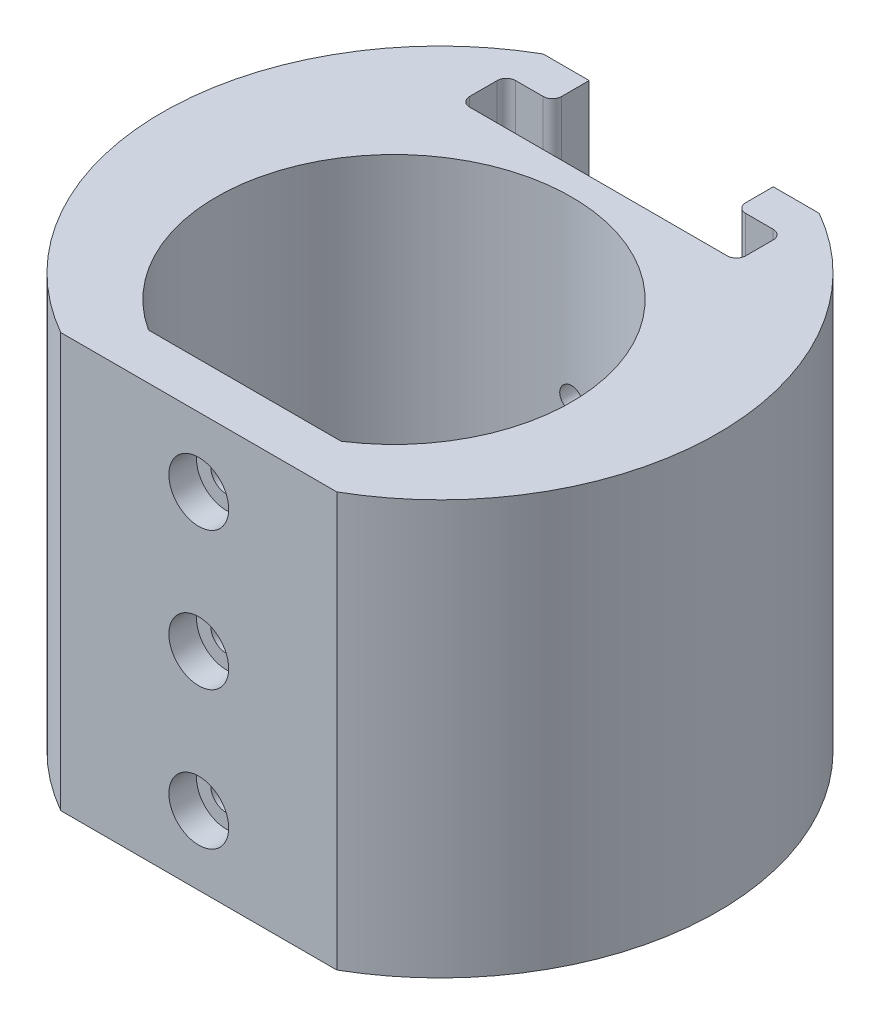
ISO-10303-21;
HEADER;
FILE_DESCRIPTION(('STEP AP214'),'2;1');
FILE_NAME('part.step','',(''),(''),'','','');
FILE_SCHEMA(('AUTOMOTIVE_DESIGN { 1 0 10303 214 1 1 1 1 }'));
ENDSEC;
DATA;
#1=APPLICATION_CONTEXT('core data for automotive mechanical design processes');
#2=APPLICATION_PROTOCOL_DEFINITION('international standard','automotive_design',2000,#1);
#3=PRODUCT_CONTEXT('',#1,'mechanical');
#4=PRODUCT('Part','Part','',(#3));
#5=PRODUCT_RELATED_PRODUCT_CATEGORY('part','',(#4));
#6=PRODUCT_DEFINITION_FORMATION('','',#4);
#7=PRODUCT_DEFINITION_CONTEXT('part definition',#1,'design');
#8=PRODUCT_DEFINITION('design','',#6,#7);
#9=PRODUCT_DEFINITION_SHAPE('','',#8);
#10=(LENGTH_UNIT() NAMED_UNIT(*) SI_UNIT(.MILLI.,.METRE.));
#11=(NAMED_UNIT(*) PLANE_ANGLE_UNIT() SI_UNIT($,.RADIAN.));
#12=(NAMED_UNIT(*) SI_UNIT($,.STERADIAN.) SOLID_ANGLE_UNIT());
#13=UNCERTAINTY_MEASURE_WITH_UNIT(LENGTH_MEASURE(1.E-05),#10,'distance_accuracy_value','');
#14=(GEOMETRIC_REPRESENTATION_CONTEXT(3) GLOBAL_UNCERTAINTY_ASSIGNED_CONTEXT((#13)) GLOBAL_UNIT_ASSIGNED_CONTEXT((#10,
#11,#12)) REPRESENTATION_CONTEXT('',''));
#15=CARTESIAN_POINT('',(0.,0.,0.));
#16=DIRECTION('',(0.,0.,1.));
#17=DIRECTION('',(1.,0.,0.));
#18=AXIS2_PLACEMENT_3D('',#15,#16,#17);
#19=CARTESIAN_POINT('',(0.,22.5,-5.));
#20=DIRECTION('',(0.,1.,0.));
#21=DIRECTION('',(0.,0.,1.));
#22=AXIS2_PLACEMENT_3D('',#19,#20,#21);
#23=PLANE('',#22);
#24=DIRECTION('',(0.,0.,-1.));
#25=VECTOR('',#24,1.);
#26=CARTESIAN_POINT('',(10.,22.5,-27.2142684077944));
#27=LINE('',#26,#25);
#28=CARTESIAN_POINT('',(10.,22.5,-28.2142684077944));
#29=VERTEX_POINT('',#28);
#30=CARTESIAN_POINT('',(10.,22.5,-31.2142684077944));
#31=VERTEX_POINT('',#30);
#32=EDGE_CURVE('E384',#29,#31,#27,.T.);
#33=ORIENTED_EDGE('',*,*,#32,.F.);
#34=CARTESIAN_POINT('',(11.,22.5,-28.2142684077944));
#35=DIRECTION('',(0.,1.,0.));
#36=DIRECTION('',(0.,0.,1.));
#37=AXIS2_PLACEMENT_3D('',#34,#35,#36);
#38=CIRCLE('',#37,1.);
#39=CARTESIAN_POINT('',(11.,22.5,-27.2142684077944));
#40=VERTEX_POINT('',#39);
#41=EDGE_CURVE('E438',#29,#40,#38,.T.);
#42=ORIENTED_EDGE('',*,*,#41,.T.);
#43=DIRECTION('',(-1.,0.,0.));
#44=VECTOR('',#43,1.);
#45=CARTESIAN_POINT('',(15.,22.5,-27.2142684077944));
#46=LINE('',#45,#44);
#47=CARTESIAN_POINT('',(14.,22.5,-27.2142684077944));
#48=VERTEX_POINT('',#47);
#49=EDGE_CURVE('E381',#48,#40,#46,.T.);
#50=ORIENTED_EDGE('',*,*,#49,.F.);
#51=CARTESIAN_POINT('',(14.,22.5,-26.2142684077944));
#52=DIRECTION('',(0.,1.,0.));
#53=DIRECTION('',(0.,0.,1.));
#54=AXIS2_PLACEMENT_3D('',#51,#52,#53);
#55=CIRCLE('',#54,1.);
#56=CARTESIAN_POINT('',(15.,22.5,-26.2142684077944));
#57=VERTEX_POINT('',#56);
#58=EDGE_CURVE('E220',#48,#57,#55,.F.);
#59=ORIENTED_EDGE('',*,*,#58,.T.);
#60=DIRECTION('',(0.,0.,-1.));
#61=VECTOR('',#60,1.);
#62=CARTESIAN_POINT('',(15.,22.5,-22.2142684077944));
#63=LINE('',#62,#61);
#64=CARTESIAN_POINT('',(15.,22.5,-23.2142684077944));
#65=VERTEX_POINT('',#64);
#66=EDGE_CURVE('E378',#65,#57,#63,.T.);
#67=ORIENTED_EDGE('',*,*,#66,.F.);
#68=CARTESIAN_POINT('',(14.,22.5,-23.2142684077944));
#69=DIRECTION('',(0.,1.,0.));
#70=DIRECTION('',(0.,0.,1.));
#71=AXIS2_PLACEMENT_3D('',#68,#69,#70);
#72=CIRCLE('',#71,1.);
#73=CARTESIAN_POINT('',(14.,22.5,-22.2142684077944));
#74=VERTEX_POINT('',#73);
#75=EDGE_CURVE('E218',#65,#74,#72,.F.);
#76=ORIENTED_EDGE('',*,*,#75,.T.);
#77=DIRECTION('',(1.,0.,0.));
#78=VECTOR('',#77,1.);
#79=CARTESIAN_POINT('',(-15.,22.5,-22.2142684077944));
#80=LINE('',#79,#78);
#81=CARTESIAN_POINT('',(-14.,22.5,-22.2142684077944));
#82=VERTEX_POINT('',#81);
#83=EDGE_CURVE('E370',#82,#74,#80,.T.);
#84=ORIENTED_EDGE('',*,*,#83,.F.);
#85=CARTESIAN_POINT('',(-14.,22.5,-23.2142684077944));
#86=DIRECTION('',(0.,1.,0.));
#87=DIRECTION('',(0.,0.,1.));
#88=AXIS2_PLACEMENT_3D('',#85,#86,#87);
#89=CIRCLE('',#88,1.);
#90=CARTESIAN_POINT('',(-15.,22.5,-23.2142684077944));
#91=VERTEX_POINT('',#90);
#92=EDGE_CURVE('E222',#82,#91,#89,.F.);
#93=ORIENTED_EDGE('',*,*,#92,.T.);
#94=DIRECTION('',(0.,0.,1.));
#95=VECTOR('',#94,1.);
#96=CARTESIAN_POINT('',(-15.,22.5,-27.2142684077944));
#97=LINE('',#96,#95);
#98=CARTESIAN_POINT('',(-15.,22.5,-26.2142684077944));
#99=VERTEX_POINT('',#98);
#100=EDGE_CURVE('E367',#99,#91,#97,.T.);
#101=ORIENTED_EDGE('',*,*,#100,.F.);
#102=CARTESIAN_POINT('',(-14.,22.5,-26.2142684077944));
#103=DIRECTION('',(0.,1.,0.));
#104=DIRECTION('',(0.,0.,1.));
#105=AXIS2_PLACEMENT_3D('',#102,#103,#104);
#106=CIRCLE('',#105,1.);
#107=CARTESIAN_POINT('',(-14.,22.5,-27.2142684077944));
#108=VERTEX_POINT('',#107);
#109=EDGE_CURVE('E54',#99,#108,#106,.F.);
#110=ORIENTED_EDGE('',*,*,#109,.T.);
#111=DIRECTION('',(-1.,0.,0.));
#112=VECTOR('',#111,1.);
#113=CARTESIAN_POINT('',(-10.,22.5,-27.2142684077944));
#114=LINE('',#113,#112);
#115=CARTESIAN_POINT('',(-11.,22.5,-27.2142684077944));
#116=VERTEX_POINT('',#115);
#117=EDGE_CURVE('E181',#116,#108,#114,.T.);
#118=ORIENTED_EDGE('',*,*,#117,.F.);
#119=CARTESIAN_POINT('',(-11.,22.5,-28.2142684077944));
#120=DIRECTION('',(0.,1.,0.));
#121=DIRECTION('',(0.,0.,1.));
#122=AXIS2_PLACEMENT_3D('',#119,#120,#121);
#123=CIRCLE('',#122,1.);
#124=CARTESIAN_POINT('',(-10.,22.5,-28.2142684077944));
#125=VERTEX_POINT('',#124);
#126=EDGE_CURVE('E361',#116,#125,#123,.T.);
#127=ORIENTED_EDGE('',*,*,#126,.T.);
#128=DIRECTION('',(0.,0.,1.));
#129=VECTOR('',#128,1.);
#130=CARTESIAN_POINT('',(-10.,22.5,-31.2142684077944));
#131=LINE('',#130,#129);
#132=CARTESIAN_POINT('',(-10.,22.5,-31.2142684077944));
#133=VERTEX_POINT('',#132);
#134=EDGE_CURVE('E368',#133,#125,#131,.T.);
#135=ORIENTED_EDGE('',*,*,#134,.F.);
#136=DIRECTION('',(-1.,0.,0.));
#137=VECTOR('',#136,1.);
#138=CARTESIAN_POINT('',(-15.,22.5,-31.2142684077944));
#139=LINE('',#138,#137);
#140=CARTESIAN_POINT('',(-15.,22.5,-31.2142684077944));
#141=VERTEX_POINT('',#140);
#142=EDGE_CURVE('E411',#133,#141,#139,.T.);
#143=ORIENTED_EDGE('',*,*,#142,.T.);
#144=CARTESIAN_POINT('',(0.,22.5,-5.));
#145=DIRECTION('',(0.,1.,0.));
#146=DIRECTION('',(0.,0.,1.));
#147=AXIS2_PLACEMENT_3D('',#144,#145,#146);
#148=CIRCLE('',#147,30.2024480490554);
#149=CARTESIAN_POINT('',(-15.,22.5,21.2142684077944));
#150=VERTEX_POINT('',#149);
#151=EDGE_CURVE('E401',#141,#150,#148,.T.);
#152=ORIENTED_EDGE('',*,*,#151,.T.);
#153=DIRECTION('',(1.,0.,0.));
#154=VECTOR('',#153,1.);
#155=CARTESIAN_POINT('',(-15.,22.5,21.2142684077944));
#156=LINE('',#155,#154);
#157=CARTESIAN_POINT('',(15.,22.5,21.2142684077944));
#158=VERTEX_POINT('',#157);
#159=EDGE_CURVE('E404',#150,#158,#156,.T.);
#160=ORIENTED_EDGE('',*,*,#159,.T.);
#161=CARTESIAN_POINT('',(0.,22.5,-5.));
#162=DIRECTION('',(0.,1.,0.));
#163=DIRECTION('',(0.,0.,1.));
#164=AXIS2_PLACEMENT_3D('',#161,#162,#163);
#165=CIRCLE('',#164,30.2024480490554);
#166=CARTESIAN_POINT('',(15.,22.5,-31.2142684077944));
#167=VERTEX_POINT('',#166);
#168=EDGE_CURVE('E408',#158,#167,#165,.T.);
#169=ORIENTED_EDGE('',*,*,#168,.T.);
#170=EDGE_CURVE('E412',#167,#31,#139,.T.);
#171=ORIENTED_EDGE('',*,*,#170,.T.);
#172=EDGE_LOOP('',(#33,#42,#50,#59,#67,#76,#84,#93,#101,#110,#118,#127,#135,#143,#152,#160,#169,#171));
#173=FACE_BOUND('',#172,.T.);
#174=DIRECTION('',(1.,0.,0.));
#175=VECTOR('',#174,1.);
#176=CARTESIAN_POINT('',(-10.,22.5,16.2142684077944));
#177=LINE('',#176,#175);
#178=CARTESIAN_POINT('',(-10.4684048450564,22.5,16.2142684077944));
#179=VERTEX_POINT('',#178);
#180=CARTESIAN_POINT('',(10.4684048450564,22.5,16.2142684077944));
#181=VERTEX_POINT('',#180);
#182=EDGE_CURVE('E83',#179,#181,#177,.T.);
#183=ORIENTED_EDGE('',*,*,#182,.F.);
#184=CARTESIAN_POINT('',(0.,22.5,0.));
#185=DIRECTION('',(0.,1.,0.));
#186=DIRECTION('',(0.,0.,1.));
#187=AXIS2_PLACEMENT_3D('',#184,#185,#186);
#188=CIRCLE('',#187,19.3);
#189=EDGE_CURVE('E397',#181,#179,#188,.T.);
#190=ORIENTED_EDGE('',*,*,#189,.F.);
#191=EDGE_LOOP('',(#183,#190));
#192=FACE_BOUND('',#191,.T.);
#193=ADVANCED_FACE('F43',(#173,#192),#23,.T.);
#194=CARTESIAN_POINT('',(0.,-22.5,-5.));
#195=DIRECTION('',(0.,1.,0.));
#196=DIRECTION('',(0.,0.,1.));
#197=AXIS2_PLACEMENT_3D('',#194,#195,#196);
#198=PLANE('',#197);
#199=CARTESIAN_POINT('',(0.,-22.5,-5.));
#200=DIRECTION('',(0.,1.,0.));
#201=DIRECTION('',(0.,0.,1.));
#202=AXIS2_PLACEMENT_3D('',#199,#200,#201);
#203=CIRCLE('',#202,30.2024480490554);
#204=CARTESIAN_POINT('',(-15.,-22.5,-31.2142684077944));
#205=VERTEX_POINT('',#204);
#206=CARTESIAN_POINT('',(-15.,-22.5,21.2142684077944));
#207=VERTEX_POINT('',#206);
#208=EDGE_CURVE('E416',#205,#207,#203,.T.);
#209=ORIENTED_EDGE('',*,*,#208,.F.);
#210=DIRECTION('',(-1.,0.,0.));
#211=VECTOR('',#210,1.);
#212=CARTESIAN_POINT('',(-15.,-22.5,-31.2142684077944));
#213=LINE('',#212,#211);
#214=CARTESIAN_POINT('',(15.,-22.5,-31.2142684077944));
#215=VERTEX_POINT('',#214);
#216=EDGE_CURVE('E405',#215,#205,#213,.T.);
#217=ORIENTED_EDGE('',*,*,#216,.F.);
#218=CARTESIAN_POINT('',(0.,-22.5,-5.));
#219=DIRECTION('',(0.,1.,0.));
#220=DIRECTION('',(0.,0.,1.));
#221=AXIS2_PLACEMENT_3D('',#218,#219,#220);
#222=CIRCLE('',#221,30.2024480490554);
#223=CARTESIAN_POINT('',(15.,-22.5,21.2142684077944));
#224=VERTEX_POINT('',#223);
#225=EDGE_CURVE('E421',#224,#215,#222,.T.);
#226=ORIENTED_EDGE('',*,*,#225,.F.);
#227=DIRECTION('',(1.,0.,0.));
#228=VECTOR('',#227,1.);
#229=CARTESIAN_POINT('',(-15.,-22.5,21.2142684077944));
#230=LINE('',#229,#228);
#231=EDGE_CURVE('E92',#207,#224,#230,.T.);
#232=ORIENTED_EDGE('',*,*,#231,.F.);
#233=EDGE_LOOP('',(#209,#217,#226,#232));
#234=FACE_BOUND('',#233,.T.);
#235=CARTESIAN_POINT('',(0.,-22.5,0.));
#236=DIRECTION('',(0.,1.,0.));
#237=DIRECTION('',(0.,0.,1.));
#238=AXIS2_PLACEMENT_3D('',#235,#236,#237);
#239=CIRCLE('',#238,19.3);
#240=CARTESIAN_POINT('',(10.4684048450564,-22.5,16.2142684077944));
#241=VERTEX_POINT('',#240);
#242=CARTESIAN_POINT('',(-10.4684048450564,-22.5,16.2142684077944));
#243=VERTEX_POINT('',#242);
#244=EDGE_CURVE('E391',#241,#243,#239,.T.);
#245=ORIENTED_EDGE('',*,*,#244,.T.);
#246=DIRECTION('',(1.,0.,0.));
#247=VECTOR('',#246,1.);
#248=CARTESIAN_POINT('',(-10.,-22.5,16.2142684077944));
#249=LINE('',#248,#247);
#250=EDGE_CURVE('E398',#243,#241,#249,.T.);
#251=ORIENTED_EDGE('',*,*,#250,.T.);
#252=EDGE_LOOP('',(#245,#251));
#253=FACE_BOUND('',#252,.T.);
#254=ADVANCED_FACE('F320',(#234,#253),#198,.F.);
#255=CARTESIAN_POINT('',(0.,22.5,-5.));
#256=DIRECTION('',(0.,-1.,0.));
#257=DIRECTION('',(0.,0.,-1.));
#258=AXIS2_PLACEMENT_3D('',#255,#256,#257);
#259=CYLINDRICAL_SURFACE('',#258,30.2024480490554);
#260=ORIENTED_EDGE('',*,*,#208,.T.);
#261=DIRECTION('',(0.,-1.,0.));
#262=VECTOR('',#261,1.);
#263=CARTESIAN_POINT('',(-15.,22.5,21.2142684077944));
#264=LINE('',#263,#262);
#265=EDGE_CURVE('E432',#150,#207,#264,.T.);
#266=ORIENTED_EDGE('',*,*,#265,.F.);
#267=ORIENTED_EDGE('',*,*,#151,.F.);
#268=DIRECTION('',(0.,-1.,0.));
#269=VECTOR('',#268,1.);
#270=CARTESIAN_POINT('',(-15.,22.5,-31.2142684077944));
#271=LINE('',#270,#269);
#272=EDGE_CURVE('E415',#141,#205,#271,.T.);
#273=ORIENTED_EDGE('',*,*,#272,.T.);
#274=EDGE_LOOP('',(#260,#266,#267,#273));
#275=FACE_BOUND('',#274,.T.);
#276=ADVANCED_FACE('F324',(#275),#259,.T.);
#277=CARTESIAN_POINT('',(-15.,22.5,21.2142684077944));
#278=DIRECTION('',(0.,0.,-1.));
#279=DIRECTION('',(-1.,0.,0.));
#280=AXIS2_PLACEMENT_3D('',#277,#278,#279);
#281=PLANE('',#280);
#282=CARTESIAN_POINT('',(0.,15.,21.2142684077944));
#283=DIRECTION('',(0.,0.,1.));
#284=DIRECTION('',(1.,0.,0.));
#285=AXIS2_PLACEMENT_3D('',#282,#283,#284);
#286=CIRCLE('',#285,3.25);
#287=CARTESIAN_POINT('',(3.25,15.,21.2142684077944));
#288=VERTEX_POINT('',#287);
#289=EDGE_CURVE('E512',#288,#288,#286,.T.);
#290=ORIENTED_EDGE('',*,*,#289,.F.);
#291=EDGE_LOOP('',(#290));
#292=FACE_BOUND('',#291,.T.);
#293=CARTESIAN_POINT('',(0.,0.,21.2142684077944));
#294=DIRECTION('',(0.,0.,1.));
#295=DIRECTION('',(1.,0.,0.));
#296=AXIS2_PLACEMENT_3D('',#293,#294,#295);
#297=CIRCLE('',#296,3.25);
#298=CARTESIAN_POINT('',(3.25,0.,21.2142684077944));
#299=VERTEX_POINT('',#298);
#300=EDGE_CURVE('E500',#299,#299,#297,.T.);
#301=ORIENTED_EDGE('',*,*,#300,.F.);
#302=EDGE_LOOP('',(#301));
#303=FACE_BOUND('',#302,.T.);
#304=CARTESIAN_POINT('',(1.56198175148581E-13,-15.,21.2142684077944));
#305=DIRECTION('',(0.,0.,1.));
#306=DIRECTION('',(1.,0.,0.));
#307=AXIS2_PLACEMENT_3D('',#304,#305,#306);
#308=CIRCLE('',#307,3.25);
#309=CARTESIAN_POINT('',(3.25000000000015,-15.,21.2142684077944));
#310=VERTEX_POINT('',#309);
#311=EDGE_CURVE('E488',#310,#310,#308,.T.);
#312=ORIENTED_EDGE('',*,*,#311,.F.);
#313=EDGE_LOOP('',(#312));
#314=FACE_BOUND('',#313,.T.);
#315=ORIENTED_EDGE('',*,*,#231,.T.);
#316=DIRECTION('',(0.,-1.,0.));
#317=VECTOR('',#316,1.);
#318=CARTESIAN_POINT('',(15.,22.5,21.2142684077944));
#319=LINE('',#318,#317);
#320=EDGE_CURVE('E429',#158,#224,#319,.T.);
#321=ORIENTED_EDGE('',*,*,#320,.F.);
#322=ORIENTED_EDGE('',*,*,#159,.F.);
#323=ORIENTED_EDGE('',*,*,#265,.T.);
#324=EDGE_LOOP('',(#315,#321,#322,#323));
#325=FACE_BOUND('',#324,.T.);
#326=ADVANCED_FACE('F332',(#292,#303,#314,#325),#281,.F.);
#327=CARTESIAN_POINT('',(0.,22.5,-5.));
#328=DIRECTION('',(0.,-1.,0.));
#329=DIRECTION('',(0.,0.,-1.));
#330=AXIS2_PLACEMENT_3D('',#327,#328,#329);
#331=CYLINDRICAL_SURFACE('',#330,30.2024480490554);
#332=ORIENTED_EDGE('',*,*,#225,.T.);
#333=DIRECTION('',(0.,-1.,0.));
#334=VECTOR('',#333,1.);
#335=CARTESIAN_POINT('',(15.,22.5,-31.2142684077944));
#336=LINE('',#335,#334);
#337=EDGE_CURVE('E426',#167,#215,#336,.T.);
#338=ORIENTED_EDGE('',*,*,#337,.F.);
#339=ORIENTED_EDGE('',*,*,#168,.F.);
#340=ORIENTED_EDGE('',*,*,#320,.T.);
#341=EDGE_LOOP('',(#332,#338,#339,#340));
#342=FACE_BOUND('',#341,.T.);
#343=ADVANCED_FACE('F328',(#342),#331,.T.);
#344=CARTESIAN_POINT('',(-15.,22.5,-31.2142684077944));
#345=DIRECTION('',(0.,0.,1.));
#346=DIRECTION('',(1.,0.,0.));
#347=AXIS2_PLACEMENT_3D('',#344,#345,#346);
#348=PLANE('',#347);
#349=DIRECTION('',(-1.,0.,0.));
#350=VECTOR('',#349,1.);
#351=CARTESIAN_POINT('',(10.,-13.5,-31.2142684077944));
#352=LINE('',#351,#350);
#353=CARTESIAN_POINT('',(10.,-13.5,-31.2142684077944));
#354=VERTEX_POINT('',#353);
#355=CARTESIAN_POINT('',(-10.,-13.5,-31.2142684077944));
#356=VERTEX_POINT('',#355);
#357=EDGE_CURVE('E387',#354,#356,#352,.T.);
#358=ORIENTED_EDGE('',*,*,#357,.F.);
#359=DIRECTION('',(0.,1.,0.));
#360=VECTOR('',#359,1.);
#361=CARTESIAN_POINT('',(10.,-13.5,-31.2142684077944));
#362=LINE('',#361,#360);
#363=EDGE_CURVE('E388',#354,#31,#362,.T.);
#364=ORIENTED_EDGE('',*,*,#363,.T.);
#365=ORIENTED_EDGE('',*,*,#170,.F.);
#366=ORIENTED_EDGE('',*,*,#337,.T.);
#367=ORIENTED_EDGE('',*,*,#216,.T.);
#368=ORIENTED_EDGE('',*,*,#272,.F.);
#369=ORIENTED_EDGE('',*,*,#142,.F.);
#370=DIRECTION('',(0.,1.,0.));
#371=VECTOR('',#370,1.);
#372=CARTESIAN_POINT('',(-10.,-13.5,-31.2142684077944));
#373=LINE('',#372,#371);
#374=EDGE_CURVE('E392',#356,#133,#373,.T.);
#375=ORIENTED_EDGE('',*,*,#374,.F.);
#376=EDGE_LOOP('',(#358,#364,#365,#366,#367,#368,#369,#375));
#377=FACE_BOUND('',#376,.T.);
#378=ADVANCED_FACE('F325',(#377),#348,.F.);
#379=CARTESIAN_POINT('',(0.,22.5,0.));
#380=DIRECTION('',(0.,-1.,0.));
#381=DIRECTION('',(0.,0.,-1.));
#382=AXIS2_PLACEMENT_3D('',#379,#380,#381);
#383=CYLINDRICAL_SURFACE('',#382,19.3);
#384=CARTESIAN_POINT('',(1.24298409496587,3.36774819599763,-19.2599322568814));
#385=CARTESIAN_POINT('',(1.25039809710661,3.43745864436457,-19.2594541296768));
#386=CARTESIAN_POINT('',(1.25193967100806,3.50784556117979,-19.2593527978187));
#387=CARTESIAN_POINT('',(1.24320212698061,3.64793449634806,-19.2599185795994));
#388=CARTESIAN_POINT('',(1.2329093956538,3.71763563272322,-19.2605865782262));
#389=CARTESIAN_POINT('',(1.20079252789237,3.85428652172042,-19.262615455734));
#390=CARTESIAN_POINT('',(1.17897427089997,3.9212376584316,-19.2639759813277));
#391=CARTESIAN_POINT('',(1.12443836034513,4.05050832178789,-19.2672359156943));
#392=CARTESIAN_POINT('',(1.09172317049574,4.11282889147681,-19.269135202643));
#393=CARTESIAN_POINT('',(1.01627626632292,4.23117199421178,-19.2732614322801));
#394=CARTESIAN_POINT('',(0.973532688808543,4.2871869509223,-19.2754887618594));
#395=CARTESIAN_POINT('',(0.879257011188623,4.39125587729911,-19.2800188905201));
#396=CARTESIAN_POINT('',(0.827724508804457,4.43930948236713,-19.282321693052));
#397=CARTESIAN_POINT('',(0.717243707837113,4.52616074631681,-19.286747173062));
#398=CARTESIAN_POINT('',(0.658284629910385,4.56494470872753,-19.2888695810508));
#399=CARTESIAN_POINT('',(0.5346786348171,4.63206203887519,-19.2926912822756));
#400=CARTESIAN_POINT('',(0.470031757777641,4.66039548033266,-19.2943905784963));
#401=CARTESIAN_POINT('',(0.336936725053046,4.70578326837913,-19.2971732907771));
#402=CARTESIAN_POINT('',(0.268491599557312,4.72284646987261,-19.2982571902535));
#403=CARTESIAN_POINT('',(0.129700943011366,4.74523835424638,-19.2996889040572));
#404=CARTESIAN_POINT('',(0.0593554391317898,4.7505672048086,-19.3000367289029));
#405=CARTESIAN_POINT('',(-0.0811021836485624,4.7493382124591,-19.2999571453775));
#406=CARTESIAN_POINT('',(-0.151214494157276,4.74280205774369,-19.2995311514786));
#407=CARTESIAN_POINT('',(-0.2893438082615,4.71807347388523,-19.2979546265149));
#408=CARTESIAN_POINT('',(-0.357360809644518,4.69988103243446,-19.2968040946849));
#409=CARTESIAN_POINT('',(-0.48937139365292,4.65236142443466,-19.2939078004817));
#410=CARTESIAN_POINT('',(-0.553365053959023,4.62303447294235,-19.2921620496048));
#411=CARTESIAN_POINT('',(-0.675525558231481,4.55408009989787,-19.2882711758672));
#412=CARTESIAN_POINT('',(-0.733692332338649,4.51445255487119,-19.2861260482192));
#413=CARTESIAN_POINT('',(-0.842661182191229,4.42593648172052,-19.2816728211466));
#414=CARTESIAN_POINT('',(-0.893449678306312,4.37703125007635,-19.2793644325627));
#415=CARTESIAN_POINT('',(-0.986101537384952,4.27138836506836,-19.2748478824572));
#416=CARTESIAN_POINT('',(-1.0279648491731,4.21465066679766,-19.2726397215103));
#417=CARTESIAN_POINT('',(-1.10161048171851,4.09489464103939,-19.2685708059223));
#418=CARTESIAN_POINT('',(-1.13338442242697,4.03187114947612,-19.2667103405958));
#419=CARTESIAN_POINT('',(-1.18589596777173,3.90136969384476,-19.2635496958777));
#420=CARTESIAN_POINT('',(-1.20663368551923,3.83389177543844,-19.2622495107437));
#421=CARTESIAN_POINT('',(-1.23645514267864,3.69650146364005,-19.2603583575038));
#422=CARTESIAN_POINT('',(-1.24555583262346,3.62659276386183,-19.2597663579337));
#423=CARTESIAN_POINT('',(-1.25189673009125,3.48623762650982,-19.2593552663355));
#424=CARTESIAN_POINT('',(-1.24913705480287,3.41579119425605,-19.2595361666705));
#425=CARTESIAN_POINT('',(-1.23184994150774,3.27646941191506,-19.2606494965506));
#426=CARTESIAN_POINT('',(-1.21733982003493,3.20759190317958,-19.2615808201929));
#427=CARTESIAN_POINT('',(-1.1769898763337,3.07325212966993,-19.2640883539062));
#428=CARTESIAN_POINT('',(-1.15114999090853,3.00778988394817,-19.2656645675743));
#429=CARTESIAN_POINT('',(-1.08885144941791,2.88207789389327,-19.2692857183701));
#430=CARTESIAN_POINT('',(-1.05238415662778,2.82183244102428,-19.2713310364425));
#431=CARTESIAN_POINT('',(-0.969872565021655,2.7083111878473,-19.2756594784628));
#432=CARTESIAN_POINT('',(-0.923828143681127,2.65503547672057,-19.2779426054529));
#433=CARTESIAN_POINT('',(-0.823368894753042,2.55686426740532,-19.2824944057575));
#434=CARTESIAN_POINT('',(-0.768938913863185,2.51198427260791,-19.2847630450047));
#435=CARTESIAN_POINT('',(-0.653308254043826,2.43199700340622,-19.2890261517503));
#436=CARTESIAN_POINT('',(-0.592107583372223,2.39688971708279,-19.2910206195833));
#437=CARTESIAN_POINT('',(-0.464667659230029,2.33744788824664,-19.2945106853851));
#438=CARTESIAN_POINT('',(-0.398428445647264,2.31311326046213,-19.2960062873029));
#439=CARTESIAN_POINT('',(-0.262792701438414,2.27591461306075,-19.2983299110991));
#440=CARTESIAN_POINT('',(-0.193396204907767,2.26305046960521,-19.2991579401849));
#441=CARTESIAN_POINT('',(-0.0535516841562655,2.24917607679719,-19.3000521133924));
#442=CARTESIAN_POINT('',(0.0168941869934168,2.24814421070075,-19.3001196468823));
#443=CARTESIAN_POINT('',(0.156957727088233,2.25790801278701,-19.2994888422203));
#444=CARTESIAN_POINT('',(0.226575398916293,2.26870363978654,-19.2987905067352));
#445=CARTESIAN_POINT('',(0.362951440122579,2.30179885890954,-19.2967073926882));
#446=CARTESIAN_POINT('',(0.429711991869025,2.32408949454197,-19.2953231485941));
#447=CARTESIAN_POINT('',(0.558542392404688,2.37953221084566,-19.2920239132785));
#448=CARTESIAN_POINT('',(0.620612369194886,2.4126839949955,-19.2901089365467));
#449=CARTESIAN_POINT('',(0.738396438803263,2.48896068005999,-19.2859600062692));
#450=CARTESIAN_POINT('',(0.794101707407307,2.53209918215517,-19.2837256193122));
#451=CARTESIAN_POINT('',(0.897501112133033,2.62711840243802,-19.2791902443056));
#452=CARTESIAN_POINT('',(0.945193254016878,2.67900129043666,-19.2768892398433));
#453=CARTESIAN_POINT('',(1.03128399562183,2.79013695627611,-19.2724757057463));
#454=CARTESIAN_POINT('',(1.06966462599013,2.84940365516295,-19.2703635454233));
#455=CARTESIAN_POINT('',(1.13588892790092,2.97350945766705,-19.2665737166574));
#456=CARTESIAN_POINT('',(1.16374484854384,3.03834197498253,-19.2648955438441));
#457=CARTESIAN_POINT('',(1.20014400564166,3.14761421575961,-19.2626543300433));
#458=CARTESIAN_POINT('',(1.21202894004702,3.19096770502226,-19.2619074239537));
#459=CARTESIAN_POINT('',(1.23107405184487,3.27870431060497,-19.2606995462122));
#460=CARTESIAN_POINT('',(1.2382342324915,3.32308742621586,-19.2602385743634));
#461=CARTESIAN_POINT('',(1.24298409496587,3.36774819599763,-19.2599322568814));
#462=B_SPLINE_CURVE_WITH_KNOTS('',3,(#384,#385,#386,#387,#388,#389,#390,#391,#392,#393,#394,
#395,#396,#397,#398,#399,#400,#401,#402,#403,#404,#405,#406,#407,#408,#409,#410,#411,#412,#413,
#414,#415,#416,#417,#418,#419,#420,#421,#422,#423,#424,#425,#426,#427,#428,#429,#430,#431,#432,
#433,#434,#435,#436,#437,#438,#439,#440,#441,#442,#443,#444,#445,#446,#447,#448,#449,#450,#451,
#452,#453,#454,#455,#456,#457,#458,#459,#460,#461),.UNSPECIFIED.,.T.,.F.,(4,2,2,2,2,2,2,2,2,2,2,
2,2,2,2,2,2,2,2,2,2,2,2,2,2,2,2,2,2,2,2,2,2,2,2,2,2,2,4),(0.,0.210151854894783,
0.420545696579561,0.630832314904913,0.84107142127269,1.05156049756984,1.26205921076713,
1.47286705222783,1.68367340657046,1.89431393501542,2.10495145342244,2.31520433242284,
2.52545743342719,2.73570647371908,2.94595803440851,3.15659178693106,3.3672267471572,
3.57803620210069,3.78884349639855,3.99934337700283,4.20984117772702,4.42002933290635,
4.63021866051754,4.84057928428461,5.05094259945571,5.26169061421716,5.47243837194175,
5.68318446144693,5.89392827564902,6.10428701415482,6.31464502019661,6.52483937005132,
6.73502798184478,6.945504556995,7.15603343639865,7.36696541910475,7.57765114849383,
7.71228735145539,7.84692346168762),.UNSPECIFIED.);
#463=CARTESIAN_POINT('',(1.24298409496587,3.36774819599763,-19.2599322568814));
#464=VERTEX_POINT('',#463);
#465=EDGE_CURVE('E225',#464,#464,#462,.T.);
#466=ORIENTED_EDGE('',*,*,#465,.F.);
#467=EDGE_LOOP('',(#466));
#468=FACE_BOUND('',#467,.T.);
#469=CARTESIAN_POINT('',(1.24298409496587,-6.63225180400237,-19.2599322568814));
#470=CARTESIAN_POINT('',(1.25039809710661,-6.56254135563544,-19.2594541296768));
#471=CARTESIAN_POINT('',(1.25193967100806,-6.49215443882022,-19.2593527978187));
#472=CARTESIAN_POINT('',(1.24320212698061,-6.35206550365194,-19.2599185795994));
#473=CARTESIAN_POINT('',(1.2329093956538,-6.28236436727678,-19.2605865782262));
#474=CARTESIAN_POINT('',(1.20079252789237,-6.14571347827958,-19.262615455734));
#475=CARTESIAN_POINT('',(1.17897427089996,-6.0787623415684,-19.2639759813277));
#476=CARTESIAN_POINT('',(1.12443836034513,-5.9494916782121,-19.2672359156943));
#477=CARTESIAN_POINT('',(1.09172317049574,-5.88717110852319,-19.269135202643));
#478=CARTESIAN_POINT('',(1.01627626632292,-5.76882800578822,-19.2732614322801));
#479=CARTESIAN_POINT('',(0.973532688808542,-5.7128130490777,-19.2754887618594));
#480=CARTESIAN_POINT('',(0.879257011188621,-5.60874412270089,-19.2800188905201));
#481=CARTESIAN_POINT('',(0.827724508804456,-5.56069051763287,-19.282321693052));
#482=CARTESIAN_POINT('',(0.717243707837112,-5.47383925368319,-19.286747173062));
#483=CARTESIAN_POINT('',(0.658284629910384,-5.43505529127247,-19.2888695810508));
#484=CARTESIAN_POINT('',(0.534678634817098,-5.36793796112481,-19.2926912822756));
#485=CARTESIAN_POINT('',(0.47003175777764,-5.33960451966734,-19.2943905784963));
#486=CARTESIAN_POINT('',(0.336936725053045,-5.29421673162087,-19.2971732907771));
#487=CARTESIAN_POINT('',(0.268491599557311,-5.27715353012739,-19.2982571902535));
#488=CARTESIAN_POINT('',(0.129700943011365,-5.25476164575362,-19.2996889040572));
#489=CARTESIAN_POINT('',(0.0593554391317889,-5.2494327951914,-19.3000367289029));
#490=CARTESIAN_POINT('',(-0.0811021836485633,-5.2506617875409,-19.2999571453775));
#491=CARTESIAN_POINT('',(-0.151214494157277,-5.25719794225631,-19.2995311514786));
#492=CARTESIAN_POINT('',(-0.289343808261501,-5.28192652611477,-19.2979546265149));
#493=CARTESIAN_POINT('',(-0.357360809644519,-5.30011896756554,-19.2968040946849));
#494=CARTESIAN_POINT('',(-0.48937139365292,-5.34763857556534,-19.2939078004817));
#495=CARTESIAN_POINT('',(-0.553365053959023,-5.37696552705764,-19.2921620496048));
#496=CARTESIAN_POINT('',(-0.675525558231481,-5.44591990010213,-19.2882711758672));
#497=CARTESIAN_POINT('',(-0.733692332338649,-5.48554744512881,-19.2861260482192));
#498=CARTESIAN_POINT('',(-0.84266118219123,-5.57406351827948,-19.2816728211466));
#499=CARTESIAN_POINT('',(-0.893449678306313,-5.62296874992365,-19.2793644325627));
#500=CARTESIAN_POINT('',(-0.986101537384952,-5.72861163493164,-19.2748478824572));
#501=CARTESIAN_POINT('',(-1.02796484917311,-5.78534933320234,-19.2726397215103));
#502=CARTESIAN_POINT('',(-1.10161048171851,-5.90510535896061,-19.2685708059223));
#503=CARTESIAN_POINT('',(-1.13338442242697,-5.96812885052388,-19.2667103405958));
#504=CARTESIAN_POINT('',(-1.18589596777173,-6.09863030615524,-19.2635496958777));
#505=CARTESIAN_POINT('',(-1.20663368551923,-6.16610822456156,-19.2622495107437));
#506=CARTESIAN_POINT('',(-1.23645514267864,-6.30349853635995,-19.2603583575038));
#507=CARTESIAN_POINT('',(-1.24555583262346,-6.37340723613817,-19.2597663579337));
#508=CARTESIAN_POINT('',(-1.25189673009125,-6.51376237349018,-19.2593552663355));
#509=CARTESIAN_POINT('',(-1.24913705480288,-6.58420880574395,-19.2595361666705));
#510=CARTESIAN_POINT('',(-1.23184994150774,-6.72353058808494,-19.2606494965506));
#511=CARTESIAN_POINT('',(-1.21733982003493,-6.79240809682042,-19.2615808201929));
#512=CARTESIAN_POINT('',(-1.1769898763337,-6.92674787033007,-19.2640883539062));
#513=CARTESIAN_POINT('',(-1.15114999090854,-6.99221011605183,-19.2656645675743));
#514=CARTESIAN_POINT('',(-1.08885144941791,-7.11792210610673,-19.2692857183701));
#515=CARTESIAN_POINT('',(-1.05238415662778,-7.17816755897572,-19.2713310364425));
#516=CARTESIAN_POINT('',(-0.969872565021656,-7.2916888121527,-19.2756594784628));
#517=CARTESIAN_POINT('',(-0.923828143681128,-7.34496452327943,-19.2779426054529));
#518=CARTESIAN_POINT('',(-0.823368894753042,-7.44313573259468,-19.2824944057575));
#519=CARTESIAN_POINT('',(-0.768938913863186,-7.48801572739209,-19.2847630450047));
#520=CARTESIAN_POINT('',(-0.653308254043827,-7.56800299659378,-19.2890261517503));
#521=CARTESIAN_POINT('',(-0.592107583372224,-7.60311028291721,-19.2910206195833));
#522=CARTESIAN_POINT('',(-0.464667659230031,-7.66255211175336,-19.2945106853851));
#523=CARTESIAN_POINT('',(-0.398428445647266,-7.68688673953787,-19.2960062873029));
#524=CARTESIAN_POINT('',(-0.262792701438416,-7.72408538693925,-19.2983299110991));
#525=CARTESIAN_POINT('',(-0.193396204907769,-7.73694953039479,-19.2991579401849));
#526=CARTESIAN_POINT('',(-0.0535516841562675,-7.75082392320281,-19.3000521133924));
#527=CARTESIAN_POINT('',(0.0168941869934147,-7.75185578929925,-19.3001196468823));
#528=CARTESIAN_POINT('',(0.156957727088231,-7.74209198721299,-19.2994888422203));
#529=CARTESIAN_POINT('',(0.226575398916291,-7.73129636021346,-19.2987905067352));
#530=CARTESIAN_POINT('',(0.362951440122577,-7.69820114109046,-19.2967073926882));
#531=CARTESIAN_POINT('',(0.429711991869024,-7.67591050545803,-19.2953231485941));
#532=CARTESIAN_POINT('',(0.558542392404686,-7.62046778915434,-19.2920239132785));
#533=CARTESIAN_POINT('',(0.620612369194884,-7.5873160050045,-19.2901089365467));
#534=CARTESIAN_POINT('',(0.738396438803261,-7.51103931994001,-19.2859600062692));
#535=CARTESIAN_POINT('',(0.794101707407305,-7.46790081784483,-19.2837256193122));
#536=CARTESIAN_POINT('',(0.897501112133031,-7.37288159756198,-19.2791902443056));
#537=CARTESIAN_POINT('',(0.945193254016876,-7.32099870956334,-19.2768892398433));
#538=CARTESIAN_POINT('',(1.03128399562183,-7.20986304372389,-19.2724757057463));
#539=CARTESIAN_POINT('',(1.06966462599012,-7.15059634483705,-19.2703635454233));
#540=CARTESIAN_POINT('',(1.13588892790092,-7.02649054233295,-19.2665737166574));
#541=CARTESIAN_POINT('',(1.16374484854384,-6.96165802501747,-19.2648955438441));
#542=CARTESIAN_POINT('',(1.20014400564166,-6.85238578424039,-19.2626543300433));
#543=CARTESIAN_POINT('',(1.21202894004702,-6.80903229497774,-19.2619074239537));
#544=CARTESIAN_POINT('',(1.23107405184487,-6.72129568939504,-19.2606995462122));
#545=CARTESIAN_POINT('',(1.2382342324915,-6.67691257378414,-19.2602385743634));
#546=CARTESIAN_POINT('',(1.24298409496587,-6.63225180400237,-19.2599322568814));
#547=B_SPLINE_CURVE_WITH_KNOTS('',3,(#469,#470,#471,#472,#473,#474,#475,#476,#477,#478,#479,
#480,#481,#482,#483,#484,#485,#486,#487,#488,#489,#490,#491,#492,#493,#494,#495,#496,#497,#498,
#499,#500,#501,#502,#503,#504,#505,#506,#507,#508,#509,#510,#511,#512,#513,#514,#515,#516,#517,
#518,#519,#520,#521,#522,#523,#524,#525,#526,#527,#528,#529,#530,#531,#532,#533,#534,#535,#536,
#537,#538,#539,#540,#541,#542,#543,#544,#545,#546),.UNSPECIFIED.,.T.,.F.,(4,2,2,2,2,2,2,2,2,2,2,
2,2,2,2,2,2,2,2,2,2,2,2,2,2,2,2,2,2,2,2,2,2,2,2,2,2,2,4),(0.,0.210151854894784,
0.420545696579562,0.630832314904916,0.84107142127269,1.05156049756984,1.26205921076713,
1.47286705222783,1.68367340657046,1.89431393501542,2.10495145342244,2.31520433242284,
2.52545743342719,2.73570647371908,2.94595803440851,3.15659178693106,3.3672267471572,
3.57803620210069,3.78884349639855,3.99934337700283,4.20984117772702,4.42002933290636,
4.63021866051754,4.84057928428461,5.05094259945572,5.26169061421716,5.47243837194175,
5.68318446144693,5.89392827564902,6.10428701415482,6.31464502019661,6.52483937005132,
6.73502798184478,6.945504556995,7.15603343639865,7.36696541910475,7.57765114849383,
7.71228735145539,7.84692346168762),.UNSPECIFIED.);
#548=CARTESIAN_POINT('',(1.24298409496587,-6.63225180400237,-19.2599322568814));
#549=VERTEX_POINT('',#548);
#550=EDGE_CURVE('E234',#549,#549,#547,.T.);
#551=ORIENTED_EDGE('',*,*,#550,.F.);
#552=EDGE_LOOP('',(#551));
#553=FACE_BOUND('',#552,.T.);
#554=ORIENTED_EDGE('',*,*,#244,.F.);
#555=DIRECTION('',(0.,-1.,0.));
#556=VECTOR('',#555,1.);
#557=CARTESIAN_POINT('',(10.4684048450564,22.5,16.2142684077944));
#558=LINE('',#557,#556);
#559=EDGE_CURVE('E48',#181,#241,#558,.T.);
#560=ORIENTED_EDGE('',*,*,#559,.F.);
#561=ORIENTED_EDGE('',*,*,#189,.T.);
#562=DIRECTION('',(0.,-1.,0.));
#563=VECTOR('',#562,1.);
#564=CARTESIAN_POINT('',(-10.4684048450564,22.5,16.2142684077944));
#565=LINE('',#564,#563);
#566=EDGE_CURVE('E419',#179,#243,#565,.T.);
#567=ORIENTED_EDGE('',*,*,#566,.T.);
#568=EDGE_LOOP('',(#554,#560,#561,#567));
#569=FACE_BOUND('',#568,.T.);
#570=ADVANCED_FACE('F45',(#468,#553,#569),#383,.F.);
#571=CARTESIAN_POINT('',(-10.,22.5,16.2142684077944));
#572=DIRECTION('',(0.,0.,-1.));
#573=DIRECTION('',(-1.,0.,0.));
#574=AXIS2_PLACEMENT_3D('',#571,#572,#573);
#575=PLANE('',#574);
#576=CARTESIAN_POINT('',(0.,15.,16.2142684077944));
#577=DIRECTION('',(0.,0.,-1.));
#578=DIRECTION('',(-1.,0.,0.));
#579=AXIS2_PLACEMENT_3D('',#576,#577,#578);
#580=CIRCLE('',#579,1.7);
#581=CARTESIAN_POINT('',(-1.7,15.,16.2142684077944));
#582=VERTEX_POINT('',#581);
#583=EDGE_CURVE('E508',#582,#582,#580,.F.);
#584=ORIENTED_EDGE('',*,*,#583,.T.);
#585=EDGE_LOOP('',(#584));
#586=FACE_BOUND('',#585,.T.);
#587=CARTESIAN_POINT('',(0.,0.,16.2142684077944));
#588=DIRECTION('',(0.,0.,-1.));
#589=DIRECTION('',(-1.,0.,0.));
#590=AXIS2_PLACEMENT_3D('',#587,#588,#589);
#591=CIRCLE('',#590,1.7);
#592=CARTESIAN_POINT('',(-1.7,0.,16.2142684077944));
#593=VERTEX_POINT('',#592);
#594=EDGE_CURVE('E496',#593,#593,#591,.F.);
#595=ORIENTED_EDGE('',*,*,#594,.T.);
#596=EDGE_LOOP('',(#595));
#597=FACE_BOUND('',#596,.T.);
#598=CARTESIAN_POINT('',(1.56198175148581E-13,-15.,16.2142684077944));
#599=DIRECTION('',(0.,0.,-1.));
#600=DIRECTION('',(-1.,0.,0.));
#601=AXIS2_PLACEMENT_3D('',#598,#599,#600);
#602=CIRCLE('',#601,1.7);
#603=CARTESIAN_POINT('',(-1.69999999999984,-15.,16.2142684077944));
#604=VERTEX_POINT('',#603);
#605=EDGE_CURVE('E484',#604,#604,#602,.F.);
#606=ORIENTED_EDGE('',*,*,#605,.T.);
#607=EDGE_LOOP('',(#606));
#608=FACE_BOUND('',#607,.T.);
#609=ORIENTED_EDGE('',*,*,#250,.F.);
#610=ORIENTED_EDGE('',*,*,#566,.F.);
#611=ORIENTED_EDGE('',*,*,#182,.T.);
#612=ORIENTED_EDGE('',*,*,#559,.T.);
#613=EDGE_LOOP('',(#609,#610,#611,#612));
#614=FACE_BOUND('',#613,.T.);
#615=ADVANCED_FACE('F294',(#586,#597,#608,#614),#575,.T.);
#616=CARTESIAN_POINT('',(10.,-13.5,-27.2142684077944));
#617=DIRECTION('',(1.,0.,0.));
#618=DIRECTION('',(0.,0.,-1.));
#619=AXIS2_PLACEMENT_3D('',#616,#617,#618);
#620=PLANE('',#619);
#621=DIRECTION('',(0.,0.,-1.));
#622=VECTOR('',#621,1.);
#623=CARTESIAN_POINT('',(10.,-13.5,-27.2142684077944));
#624=LINE('',#623,#622);
#625=CARTESIAN_POINT('',(10.,-13.5,-28.2142684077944));
#626=VERTEX_POINT('',#625);
#627=EDGE_CURVE('E395',#626,#354,#624,.T.);
#628=ORIENTED_EDGE('',*,*,#627,.F.);
#629=DIRECTION('',(0.,1.,0.));
#630=VECTOR('',#629,1.);
#631=CARTESIAN_POINT('',(10.,-13.5,-28.2142684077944));
#632=LINE('',#631,#630);
#633=EDGE_CURVE('E434',#626,#29,#632,.T.);
#634=ORIENTED_EDGE('',*,*,#633,.T.);
#635=ORIENTED_EDGE('',*,*,#32,.T.);
#636=ORIENTED_EDGE('',*,*,#363,.F.);
#637=EDGE_LOOP('',(#628,#634,#635,#636));
#638=FACE_BOUND('',#637,.T.);
#639=ADVANCED_FACE('F290',(#638),#620,.F.);
#640=CARTESIAN_POINT('',(15.,-13.5,-27.2142684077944));
#641=DIRECTION('',(0.,0.,-1.));
#642=DIRECTION('',(-1.,0.,0.));
#643=AXIS2_PLACEMENT_3D('',#640,#641,#642);
#644=PLANE('',#643);
#645=ORIENTED_EDGE('',*,*,#49,.T.);
#646=DIRECTION('',(0.,1.,0.));
#647=VECTOR('',#646,1.);
#648=CARTESIAN_POINT('',(11.,-13.5,-27.2142684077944));
#649=LINE('',#648,#647);
#650=CARTESIAN_POINT('',(11.,-13.5,-27.2142684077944));
#651=VERTEX_POINT('',#650);
#652=EDGE_CURVE('E443',#40,#651,#649,.F.);
#653=ORIENTED_EDGE('',*,*,#652,.T.);
#654=DIRECTION('',(-1.,0.,0.));
#655=VECTOR('',#654,1.);
#656=CARTESIAN_POINT('',(15.,-13.5,-27.2142684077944));
#657=LINE('',#656,#655);
#658=CARTESIAN_POINT('',(14.,-13.5,-27.2142684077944));
#659=VERTEX_POINT('',#658);
#660=EDGE_CURVE('E465',#659,#651,#657,.T.);
#661=ORIENTED_EDGE('',*,*,#660,.F.);
#662=DIRECTION('',(0.,1.,0.));
#663=VECTOR('',#662,1.);
#664=CARTESIAN_POINT('',(14.,22.5,-27.2142684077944));
#665=LINE('',#664,#663);
#666=EDGE_CURVE('E440',#659,#48,#665,.T.);
#667=ORIENTED_EDGE('',*,*,#666,.T.);
#668=EDGE_LOOP('',(#645,#653,#661,#667));
#669=FACE_BOUND('',#668,.T.);
#670=ADVANCED_FACE('F293',(#669),#644,.F.);
#671=CARTESIAN_POINT('',(15.,-13.5,-22.2142684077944));
#672=DIRECTION('',(1.,0.,0.));
#673=DIRECTION('',(0.,0.,-1.));
#674=AXIS2_PLACEMENT_3D('',#671,#672,#673);
#675=PLANE('',#674);
#676=DIRECTION('',(0.,0.,-1.));
#677=VECTOR('',#676,1.);
#678=CARTESIAN_POINT('',(15.,-13.5,-22.2142684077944));
#679=LINE('',#678,#677);
#680=CARTESIAN_POINT('',(15.,-13.5,-23.2142684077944));
#681=VERTEX_POINT('',#680);
#682=CARTESIAN_POINT('',(15.,-13.5,-26.2142684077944));
#683=VERTEX_POINT('',#682);
#684=EDGE_CURVE('E463',#681,#683,#679,.T.);
#685=ORIENTED_EDGE('',*,*,#684,.F.);
#686=DIRECTION('',(0.,1.,0.));
#687=VECTOR('',#686,1.);
#688=CARTESIAN_POINT('',(15.,22.5,-23.2142684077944));
#689=LINE('',#688,#687);
#690=EDGE_CURVE('E447',#681,#65,#689,.T.);
#691=ORIENTED_EDGE('',*,*,#690,.T.);
#692=ORIENTED_EDGE('',*,*,#66,.T.);
#693=DIRECTION('',(0.,1.,0.));
#694=VECTOR('',#693,1.);
#695=CARTESIAN_POINT('',(15.,-13.5,-26.2142684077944));
#696=LINE('',#695,#694);
#697=EDGE_CURVE('E445',#57,#683,#696,.F.);
#698=ORIENTED_EDGE('',*,*,#697,.T.);
#699=EDGE_LOOP('',(#685,#691,#692,#698));
#700=FACE_BOUND('',#699,.T.);
#701=ADVANCED_FACE('F298',(#700),#675,.F.);
#702=CARTESIAN_POINT('',(-15.,-13.5,-22.2142684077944));
#703=DIRECTION('',(0.,0.,1.));
#704=DIRECTION('',(1.,0.,0.));
#705=AXIS2_PLACEMENT_3D('',#702,#703,#704);
#706=PLANE('',#705);
#707=CARTESIAN_POINT('',(0.,3.5,-22.2142684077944));
#708=DIRECTION('',(0.,0.,-1.));
#709=DIRECTION('',(-1.,0.,0.));
#710=AXIS2_PLACEMENT_3D('',#707,#708,#709);
#711=CIRCLE('',#710,1.24999999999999);
#712=CARTESIAN_POINT('',(-1.24999999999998,3.5,-22.2142684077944));
#713=VERTEX_POINT('',#712);
#714=EDGE_CURVE('E233',#713,#713,#711,.T.);
#715=ORIENTED_EDGE('',*,*,#714,.F.);
#716=EDGE_LOOP('',(#715));
#717=FACE_BOUND('',#716,.T.);
#718=CARTESIAN_POINT('',(0.,-6.5,-22.2142684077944));
#719=DIRECTION('',(0.,0.,-1.));
#720=DIRECTION('',(-1.,0.,0.));
#721=AXIS2_PLACEMENT_3D('',#718,#719,#720);
#722=CIRCLE('',#721,1.24999999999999);
#723=CARTESIAN_POINT('',(-1.24999999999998,-6.5,-22.2142684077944));
#724=VERTEX_POINT('',#723);
#725=EDGE_CURVE('E232',#724,#724,#722,.T.);
#726=ORIENTED_EDGE('',*,*,#725,.F.);
#727=EDGE_LOOP('',(#726));
#728=FACE_BOUND('',#727,.T.);
#729=ORIENTED_EDGE('',*,*,#83,.T.);
#730=DIRECTION('',(0.,1.,0.));
#731=VECTOR('',#730,1.);
#732=CARTESIAN_POINT('',(14.,-13.5,-22.2142684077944));
#733=LINE('',#732,#731);
#734=CARTESIAN_POINT('',(14.,-13.5,-22.2142684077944));
#735=VERTEX_POINT('',#734);
#736=EDGE_CURVE('E201',#74,#735,#733,.F.);
#737=ORIENTED_EDGE('',*,*,#736,.T.);
#738=DIRECTION('',(1.,0.,0.));
#739=VECTOR('',#738,1.);
#740=CARTESIAN_POINT('',(-15.,-13.5,-22.2142684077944));
#741=LINE('',#740,#739);
#742=CARTESIAN_POINT('',(-14.,-13.5,-22.2142684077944));
#743=VERTEX_POINT('',#742);
#744=EDGE_CURVE('E455',#743,#735,#741,.T.);
#745=ORIENTED_EDGE('',*,*,#744,.F.);
#746=DIRECTION('',(0.,1.,0.));
#747=VECTOR('',#746,1.);
#748=CARTESIAN_POINT('',(-14.,22.5,-22.2142684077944));
#749=LINE('',#748,#747);
#750=EDGE_CURVE('E205',#743,#82,#749,.T.);
#751=ORIENTED_EDGE('',*,*,#750,.T.);
#752=EDGE_LOOP('',(#729,#737,#745,#751));
#753=FACE_BOUND('',#752,.T.);
#754=ADVANCED_FACE('F302',(#717,#728,#753),#706,.F.);
#755=CARTESIAN_POINT('',(-15.,-13.5,-27.2142684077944));
#756=DIRECTION('',(-1.,0.,0.));
#757=DIRECTION('',(0.,0.,1.));
#758=AXIS2_PLACEMENT_3D('',#755,#756,#757);
#759=PLANE('',#758);
#760=ORIENTED_EDGE('',*,*,#100,.T.);
#761=DIRECTION('',(0.,1.,0.));
#762=VECTOR('',#761,1.);
#763=CARTESIAN_POINT('',(-15.,-13.5,-23.2142684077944));
#764=LINE('',#763,#762);
#765=CARTESIAN_POINT('',(-15.,-13.5,-23.2142684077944));
#766=VERTEX_POINT('',#765);
#767=EDGE_CURVE('E63',#91,#766,#764,.F.);
#768=ORIENTED_EDGE('',*,*,#767,.T.);
#769=DIRECTION('',(0.,0.,1.));
#770=VECTOR('',#769,1.);
#771=CARTESIAN_POINT('',(-15.,-13.5,-27.2142684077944));
#772=LINE('',#771,#770);
#773=CARTESIAN_POINT('',(-15.,-13.5,-26.2142684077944));
#774=VERTEX_POINT('',#773);
#775=EDGE_CURVE('E193',#774,#766,#772,.T.);
#776=ORIENTED_EDGE('',*,*,#775,.F.);
#777=DIRECTION('',(0.,1.,0.));
#778=VECTOR('',#777,1.);
#779=CARTESIAN_POINT('',(-15.,22.5,-26.2142684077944));
#780=LINE('',#779,#778);
#781=EDGE_CURVE('E199',#774,#99,#780,.T.);
#782=ORIENTED_EDGE('',*,*,#781,.T.);
#783=EDGE_LOOP('',(#760,#768,#776,#782));
#784=FACE_BOUND('',#783,.T.);
#785=ADVANCED_FACE('F306',(#784),#759,.F.);
#786=CARTESIAN_POINT('',(-10.,-13.5,-27.2142684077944));
#787=DIRECTION('',(0.,0.,-1.));
#788=DIRECTION('',(-1.,0.,0.));
#789=AXIS2_PLACEMENT_3D('',#786,#787,#788);
#790=PLANE('',#789);
#791=ORIENTED_EDGE('',*,*,#117,.T.);
#792=DIRECTION('',(0.,1.,0.));
#793=VECTOR('',#792,1.);
#794=CARTESIAN_POINT('',(-14.,-13.5,-27.2142684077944));
#795=LINE('',#794,#793);
#796=CARTESIAN_POINT('',(-14.,-13.5,-27.2142684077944));
#797=VERTEX_POINT('',#796);
#798=EDGE_CURVE('E174',#108,#797,#795,.F.);
#799=ORIENTED_EDGE('',*,*,#798,.T.);
#800=DIRECTION('',(-1.,0.,0.));
#801=VECTOR('',#800,1.);
#802=CARTESIAN_POINT('',(-10.,-13.5,-27.2142684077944));
#803=LINE('',#802,#801);
#804=CARTESIAN_POINT('',(-11.,-13.5,-27.2142684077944));
#805=VERTEX_POINT('',#804);
#806=EDGE_CURVE('E178',#805,#797,#803,.T.);
#807=ORIENTED_EDGE('',*,*,#806,.F.);
#808=DIRECTION('',(0.,1.,0.));
#809=VECTOR('',#808,1.);
#810=CARTESIAN_POINT('',(-11.,-13.5,-27.2142684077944));
#811=LINE('',#810,#809);
#812=EDGE_CURVE('E185',#805,#116,#811,.T.);
#813=ORIENTED_EDGE('',*,*,#812,.T.);
#814=EDGE_LOOP('',(#791,#799,#807,#813));
#815=FACE_BOUND('',#814,.T.);
#816=ADVANCED_FACE('F176',(#815),#790,.F.);
#817=CARTESIAN_POINT('',(-10.,-13.5,-31.2142684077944));
#818=DIRECTION('',(-1.,0.,0.));
#819=DIRECTION('',(0.,0.,1.));
#820=AXIS2_PLACEMENT_3D('',#817,#818,#819);
#821=PLANE('',#820);
#822=ORIENTED_EDGE('',*,*,#134,.T.);
#823=DIRECTION('',(0.,1.,0.));
#824=VECTOR('',#823,1.);
#825=CARTESIAN_POINT('',(-10.,-13.5,-28.2142684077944));
#826=LINE('',#825,#824);
#827=CARTESIAN_POINT('',(-10.,-13.5,-28.2142684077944));
#828=VERTEX_POINT('',#827);
#829=EDGE_CURVE('E184',#125,#828,#826,.F.);
#830=ORIENTED_EDGE('',*,*,#829,.T.);
#831=DIRECTION('',(0.,0.,1.));
#832=VECTOR('',#831,1.);
#833=CARTESIAN_POINT('',(-10.,-13.5,-31.2142684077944));
#834=LINE('',#833,#832);
#835=EDGE_CURVE('E194',#356,#828,#834,.T.);
#836=ORIENTED_EDGE('',*,*,#835,.F.);
#837=ORIENTED_EDGE('',*,*,#374,.T.);
#838=EDGE_LOOP('',(#822,#830,#836,#837));
#839=FACE_BOUND('',#838,.T.);
#840=ADVANCED_FACE('F289',(#839),#821,.F.);
#841=CARTESIAN_POINT('',(0.,-13.5,0.));
#842=DIRECTION('',(0.,1.,0.));
#843=DIRECTION('',(0.,0.,1.));
#844=AXIS2_PLACEMENT_3D('',#841,#842,#843);
#845=PLANE('',#844);
#846=ORIENTED_EDGE('',*,*,#744,.T.);
#847=CARTESIAN_POINT('',(14.,-13.5,-23.2142684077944));
#848=DIRECTION('',(0.,1.,0.));
#849=DIRECTION('',(0.,0.,1.));
#850=AXIS2_PLACEMENT_3D('',#847,#848,#849);
#851=CIRCLE('',#850,1.);
#852=EDGE_CURVE('E210',#735,#681,#851,.T.);
#853=ORIENTED_EDGE('',*,*,#852,.T.);
#854=ORIENTED_EDGE('',*,*,#684,.T.);
#855=CARTESIAN_POINT('',(14.,-13.5,-26.2142684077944));
#856=DIRECTION('',(0.,1.,0.));
#857=DIRECTION('',(0.,0.,1.));
#858=AXIS2_PLACEMENT_3D('',#855,#856,#857);
#859=CIRCLE('',#858,1.);
#860=EDGE_CURVE('E203',#683,#659,#859,.T.);
#861=ORIENTED_EDGE('',*,*,#860,.T.);
#862=ORIENTED_EDGE('',*,*,#660,.T.);
#863=CARTESIAN_POINT('',(11.,-13.5,-28.2142684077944));
#864=DIRECTION('',(0.,1.,0.));
#865=DIRECTION('',(0.,0.,1.));
#866=AXIS2_PLACEMENT_3D('',#863,#864,#865);
#867=CIRCLE('',#866,1.);
#868=EDGE_CURVE('E216',#651,#626,#867,.F.);
#869=ORIENTED_EDGE('',*,*,#868,.T.);
#870=ORIENTED_EDGE('',*,*,#627,.T.);
#871=ORIENTED_EDGE('',*,*,#357,.T.);
#872=ORIENTED_EDGE('',*,*,#835,.T.);
#873=CARTESIAN_POINT('',(-11.,-13.5,-28.2142684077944));
#874=DIRECTION('',(0.,1.,0.));
#875=DIRECTION('',(0.,0.,1.));
#876=AXIS2_PLACEMENT_3D('',#873,#874,#875);
#877=CIRCLE('',#876,1.);
#878=EDGE_CURVE('E12',#828,#805,#877,.F.);
#879=ORIENTED_EDGE('',*,*,#878,.T.);
#880=ORIENTED_EDGE('',*,*,#806,.T.);
#881=CARTESIAN_POINT('',(-14.,-13.5,-26.2142684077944));
#882=DIRECTION('',(0.,1.,0.));
#883=DIRECTION('',(0.,0.,1.));
#884=AXIS2_PLACEMENT_3D('',#881,#882,#883);
#885=CIRCLE('',#884,1.);
#886=EDGE_CURVE('E190',#797,#774,#885,.T.);
#887=ORIENTED_EDGE('',*,*,#886,.T.);
#888=ORIENTED_EDGE('',*,*,#775,.T.);
#889=CARTESIAN_POINT('',(-14.,-13.5,-23.2142684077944));
#890=DIRECTION('',(0.,1.,0.));
#891=DIRECTION('',(0.,0.,1.));
#892=AXIS2_PLACEMENT_3D('',#889,#890,#891);
#893=CIRCLE('',#892,1.);
#894=EDGE_CURVE('E200',#766,#743,#893,.T.);
#895=ORIENTED_EDGE('',*,*,#894,.T.);
#896=EDGE_LOOP('',(#846,#853,#854,#861,#862,#869,#870,#871,#872,#879,#880,#887,#888,#895));
#897=FACE_BOUND('',#896,.T.);
#898=ADVANCED_FACE('F189',(#897),#845,.T.);
#899=CARTESIAN_POINT('',(11.,-13.5,-28.2142684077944));
#900=DIRECTION('',(0.,1.,0.));
#901=DIRECTION('',(0.,0.,1.));
#902=AXIS2_PLACEMENT_3D('',#899,#900,#901);
#903=CYLINDRICAL_SURFACE('',#902,1.);
#904=ORIENTED_EDGE('',*,*,#868,.F.);
#905=ORIENTED_EDGE('',*,*,#652,.F.);
#906=ORIENTED_EDGE('',*,*,#41,.F.);
#907=ORIENTED_EDGE('',*,*,#633,.F.);
#908=EDGE_LOOP('',(#904,#905,#906,#907));
#909=FACE_BOUND('',#908,.T.);
#910=ADVANCED_FACE('F288',(#909),#903,.T.);
#911=CARTESIAN_POINT('',(14.,-13.5,-23.2142684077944));
#912=DIRECTION('',(0.,-1.,0.));
#913=DIRECTION('',(0.,0.,-1.));
#914=AXIS2_PLACEMENT_3D('',#911,#912,#913);
#915=CYLINDRICAL_SURFACE('',#914,1.);
#916=ORIENTED_EDGE('',*,*,#852,.F.);
#917=ORIENTED_EDGE('',*,*,#736,.F.);
#918=ORIENTED_EDGE('',*,*,#75,.F.);
#919=ORIENTED_EDGE('',*,*,#690,.F.);
#920=EDGE_LOOP('',(#916,#917,#918,#919));
#921=FACE_BOUND('',#920,.T.);
#922=ADVANCED_FACE('F342',(#921),#915,.F.);
#923=CARTESIAN_POINT('',(14.,-13.5,-26.2142684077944));
#924=DIRECTION('',(0.,-1.,0.));
#925=DIRECTION('',(0.,0.,-1.));
#926=AXIS2_PLACEMENT_3D('',#923,#924,#925);
#927=CYLINDRICAL_SURFACE('',#926,1.);
#928=ORIENTED_EDGE('',*,*,#860,.F.);
#929=ORIENTED_EDGE('',*,*,#697,.F.);
#930=ORIENTED_EDGE('',*,*,#58,.F.);
#931=ORIENTED_EDGE('',*,*,#666,.F.);
#932=EDGE_LOOP('',(#928,#929,#930,#931));
#933=FACE_BOUND('',#932,.T.);
#934=ADVANCED_FACE('F346',(#933),#927,.F.);
#935=CARTESIAN_POINT('',(-14.,-13.5,-23.2142684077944));
#936=DIRECTION('',(0.,-1.,0.));
#937=DIRECTION('',(0.,0.,-1.));
#938=AXIS2_PLACEMENT_3D('',#935,#936,#937);
#939=CYLINDRICAL_SURFACE('',#938,1.);
#940=ORIENTED_EDGE('',*,*,#894,.F.);
#941=ORIENTED_EDGE('',*,*,#767,.F.);
#942=ORIENTED_EDGE('',*,*,#92,.F.);
#943=ORIENTED_EDGE('',*,*,#750,.F.);
#944=EDGE_LOOP('',(#940,#941,#942,#943));
#945=FACE_BOUND('',#944,.T.);
#946=ADVANCED_FACE('F350',(#945),#939,.F.);
#947=CARTESIAN_POINT('',(-14.,-13.5,-26.2142684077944));
#948=DIRECTION('',(0.,-1.,0.));
#949=DIRECTION('',(0.,0.,-1.));
#950=AXIS2_PLACEMENT_3D('',#947,#948,#949);
#951=CYLINDRICAL_SURFACE('',#950,1.);
#952=ORIENTED_EDGE('',*,*,#886,.F.);
#953=ORIENTED_EDGE('',*,*,#798,.F.);
#954=ORIENTED_EDGE('',*,*,#109,.F.);
#955=ORIENTED_EDGE('',*,*,#781,.F.);
#956=EDGE_LOOP('',(#952,#953,#954,#955));
#957=FACE_BOUND('',#956,.T.);
#958=ADVANCED_FACE('F197',(#957),#951,.F.);
#959=CARTESIAN_POINT('',(-11.,-13.5,-28.2142684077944));
#960=DIRECTION('',(0.,1.,0.));
#961=DIRECTION('',(0.,0.,1.));
#962=AXIS2_PLACEMENT_3D('',#959,#960,#961);
#963=CYLINDRICAL_SURFACE('',#962,1.);
#964=ORIENTED_EDGE('',*,*,#878,.F.);
#965=ORIENTED_EDGE('',*,*,#829,.F.);
#966=ORIENTED_EDGE('',*,*,#126,.F.);
#967=ORIENTED_EDGE('',*,*,#812,.F.);
#968=EDGE_LOOP('',(#964,#965,#966,#967));
#969=FACE_BOUND('',#968,.T.);
#970=ADVANCED_FACE('F278',(#969),#963,.T.);
#971=CARTESIAN_POINT('',(1.56198175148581E-13,-15.,21.2142684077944));
#972=DIRECTION('',(0.,0.,1.));
#973=DIRECTION('',(1.,0.,0.));
#974=AXIS2_PLACEMENT_3D('',#971,#972,#973);
#975=CYLINDRICAL_SURFACE('',#974,1.7);
#976=ORIENTED_EDGE('',*,*,#605,.F.);
#977=EDGE_LOOP('',(#976));
#978=FACE_BOUND('',#977,.T.);
#979=CARTESIAN_POINT('',(1.56198175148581E-13,-15.,18.2142684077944));
#980=DIRECTION('',(0.,0.,1.));
#981=DIRECTION('',(1.,0.,0.));
#982=AXIS2_PLACEMENT_3D('',#979,#980,#981);
#983=CIRCLE('',#982,1.7);
#984=CARTESIAN_POINT('',(1.70000000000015,-15.,18.2142684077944));
#985=VERTEX_POINT('',#984);
#986=EDGE_CURVE('E487',#985,#985,#983,.T.);
#987=ORIENTED_EDGE('',*,*,#986,.T.);
#988=EDGE_LOOP('',(#987));
#989=FACE_BOUND('',#988,.T.);
#990=ADVANCED_FACE('F274',(#978,#989),#975,.F.);
#991=CARTESIAN_POINT('',(1.70000000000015,-15.,18.2142684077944));
#992=DIRECTION('',(0.,0.,-1.));
#993=DIRECTION('',(-1.,0.,0.));
#994=AXIS2_PLACEMENT_3D('',#991,#992,#993);
#995=PLANE('',#994);
#996=ORIENTED_EDGE('',*,*,#986,.F.);
#997=EDGE_LOOP('',(#996));
#998=FACE_BOUND('',#997,.T.);
#999=CARTESIAN_POINT('',(1.56198175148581E-13,-15.,18.2142684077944));
#1000=DIRECTION('',(0.,0.,1.));
#1001=DIRECTION('',(1.,0.,0.));
#1002=AXIS2_PLACEMENT_3D('',#999,#1000,#1001);
#1003=CIRCLE('',#1002,3.25);
#1004=CARTESIAN_POINT('',(3.25000000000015,-15.,18.2142684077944));
#1005=VERTEX_POINT('',#1004);
#1006=EDGE_CURVE('E372',#1005,#1005,#1003,.T.);
#1007=ORIENTED_EDGE('',*,*,#1006,.T.);
#1008=EDGE_LOOP('',(#1007));
#1009=FACE_BOUND('',#1008,.T.);
#1010=ADVANCED_FACE('F277',(#998,#1009),#995,.F.);
#1011=CARTESIAN_POINT('',(1.56198175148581E-13,-15.,21.2142684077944));
#1012=DIRECTION('',(0.,0.,1.));
#1013=DIRECTION('',(1.,0.,0.));
#1014=AXIS2_PLACEMENT_3D('',#1011,#1012,#1013);
#1015=CYLINDRICAL_SURFACE('',#1014,3.25);
#1016=ORIENTED_EDGE('',*,*,#1006,.F.);
#1017=EDGE_LOOP('',(#1016));
#1018=FACE_BOUND('',#1017,.T.);
#1019=ORIENTED_EDGE('',*,*,#311,.T.);
#1020=EDGE_LOOP('',(#1019));
#1021=FACE_BOUND('',#1020,.T.);
#1022=ADVANCED_FACE('F266',(#1018,#1021),#1015,.F.);
#1023=CARTESIAN_POINT('',(0.,0.,21.2142684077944));
#1024=DIRECTION('',(0.,0.,1.));
#1025=DIRECTION('',(1.,0.,0.));
#1026=AXIS2_PLACEMENT_3D('',#1023,#1024,#1025);
#1027=CYLINDRICAL_SURFACE('',#1026,1.7);
#1028=ORIENTED_EDGE('',*,*,#594,.F.);
#1029=EDGE_LOOP('',(#1028));
#1030=FACE_BOUND('',#1029,.T.);
#1031=CARTESIAN_POINT('',(0.,0.,18.2142684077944));
#1032=DIRECTION('',(0.,0.,1.));
#1033=DIRECTION('',(1.,0.,0.));
#1034=AXIS2_PLACEMENT_3D('',#1031,#1032,#1033);
#1035=CIRCLE('',#1034,1.7);
#1036=CARTESIAN_POINT('',(1.7,0.,18.2142684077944));
#1037=VERTEX_POINT('',#1036);
#1038=EDGE_CURVE('E499',#1037,#1037,#1035,.T.);
#1039=ORIENTED_EDGE('',*,*,#1038,.T.);
#1040=EDGE_LOOP('',(#1039));
#1041=FACE_BOUND('',#1040,.T.);
#1042=ADVANCED_FACE('F262',(#1030,#1041),#1027,.F.);
#1043=CARTESIAN_POINT('',(1.7,0.,18.2142684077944));
#1044=DIRECTION('',(0.,0.,-1.));
#1045=DIRECTION('',(-1.,0.,0.));
#1046=AXIS2_PLACEMENT_3D('',#1043,#1044,#1045);
#1047=PLANE('',#1046);
#1048=ORIENTED_EDGE('',*,*,#1038,.F.);
#1049=EDGE_LOOP('',(#1048));
#1050=FACE_BOUND('',#1049,.T.);
#1051=CARTESIAN_POINT('',(0.,0.,18.2142684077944));
#1052=DIRECTION('',(0.,0.,1.));
#1053=DIRECTION('',(1.,0.,0.));
#1054=AXIS2_PLACEMENT_3D('',#1051,#1052,#1053);
#1055=CIRCLE('',#1054,3.25);
#1056=CARTESIAN_POINT('',(3.25,0.,18.2142684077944));
#1057=VERTEX_POINT('',#1056);
#1058=EDGE_CURVE('E491',#1057,#1057,#1055,.T.);
#1059=ORIENTED_EDGE('',*,*,#1058,.T.);
#1060=EDGE_LOOP('',(#1059));
#1061=FACE_BOUND('',#1060,.T.);
#1062=ADVANCED_FACE('F265',(#1050,#1061),#1047,.F.);
#1063=CARTESIAN_POINT('',(0.,0.,21.2142684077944));
#1064=DIRECTION('',(0.,0.,1.));
#1065=DIRECTION('',(1.,0.,0.));
#1066=AXIS2_PLACEMENT_3D('',#1063,#1064,#1065);
#1067=CYLINDRICAL_SURFACE('',#1066,3.25);
#1068=ORIENTED_EDGE('',*,*,#1058,.F.);
#1069=EDGE_LOOP('',(#1068));
#1070=FACE_BOUND('',#1069,.T.);
#1071=ORIENTED_EDGE('',*,*,#300,.T.);
#1072=EDGE_LOOP('',(#1071));
#1073=FACE_BOUND('',#1072,.T.);
#1074=ADVANCED_FACE('F254',(#1070,#1073),#1067,.F.);
#1075=CARTESIAN_POINT('',(0.,15.,21.2142684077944));
#1076=DIRECTION('',(0.,0.,1.));
#1077=DIRECTION('',(1.,0.,0.));
#1078=AXIS2_PLACEMENT_3D('',#1075,#1076,#1077);
#1079=CYLINDRICAL_SURFACE('',#1078,1.7);
#1080=ORIENTED_EDGE('',*,*,#583,.F.);
#1081=EDGE_LOOP('',(#1080));
#1082=FACE_BOUND('',#1081,.T.);
#1083=CARTESIAN_POINT('',(0.,15.,18.2142684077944));
#1084=DIRECTION('',(0.,0.,1.));
#1085=DIRECTION('',(1.,0.,0.));
#1086=AXIS2_PLACEMENT_3D('',#1083,#1084,#1085);
#1087=CIRCLE('',#1086,1.7);
#1088=CARTESIAN_POINT('',(1.7,15.,18.2142684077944));
#1089=VERTEX_POINT('',#1088);
#1090=EDGE_CURVE('E511',#1089,#1089,#1087,.T.);
#1091=ORIENTED_EDGE('',*,*,#1090,.T.);
#1092=EDGE_LOOP('',(#1091));
#1093=FACE_BOUND('',#1092,.T.);
#1094=ADVANCED_FACE('F250',(#1082,#1093),#1079,.F.);
#1095=CARTESIAN_POINT('',(1.7,15.,18.2142684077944));
#1096=DIRECTION('',(0.,0.,-1.));
#1097=DIRECTION('',(-1.,0.,0.));
#1098=AXIS2_PLACEMENT_3D('',#1095,#1096,#1097);
#1099=PLANE('',#1098);
#1100=ORIENTED_EDGE('',*,*,#1090,.F.);
#1101=EDGE_LOOP('',(#1100));
#1102=FACE_BOUND('',#1101,.T.);
#1103=CARTESIAN_POINT('',(0.,15.,18.2142684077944));
#1104=DIRECTION('',(0.,0.,1.));
#1105=DIRECTION('',(1.,0.,0.));
#1106=AXIS2_PLACEMENT_3D('',#1103,#1104,#1105);
#1107=CIRCLE('',#1106,3.25);
#1108=CARTESIAN_POINT('',(3.25,15.,18.2142684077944));
#1109=VERTEX_POINT('',#1108);
#1110=EDGE_CURVE('E503',#1109,#1109,#1107,.T.);
#1111=ORIENTED_EDGE('',*,*,#1110,.T.);
#1112=EDGE_LOOP('',(#1111));
#1113=FACE_BOUND('',#1112,.T.);
#1114=ADVANCED_FACE('F253',(#1102,#1113),#1099,.F.);
#1115=CARTESIAN_POINT('',(0.,15.,21.2142684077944));
#1116=DIRECTION('',(0.,0.,1.));
#1117=DIRECTION('',(1.,0.,0.));
#1118=AXIS2_PLACEMENT_3D('',#1115,#1116,#1117);
#1119=CYLINDRICAL_SURFACE('',#1118,3.25);
#1120=ORIENTED_EDGE('',*,*,#1110,.F.);
#1121=EDGE_LOOP('',(#1120));
#1122=FACE_BOUND('',#1121,.T.);
#1123=ORIENTED_EDGE('',*,*,#289,.T.);
#1124=EDGE_LOOP('',(#1123));
#1125=FACE_BOUND('',#1124,.T.);
#1126=ADVANCED_FACE('F248',(#1122,#1125),#1119,.F.);
#1127=CARTESIAN_POINT('',(0.,-6.5,-22.2142684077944));
#1128=DIRECTION('',(0.,0.,-1.));
#1129=DIRECTION('',(-1.,0.,0.));
#1130=AXIS2_PLACEMENT_3D('',#1127,#1128,#1129);
#1131=CYLINDRICAL_SURFACE('',#1130,1.24999999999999);
#1132=ORIENTED_EDGE('',*,*,#725,.T.);
#1133=EDGE_LOOP('',(#1132));
#1134=FACE_BOUND('',#1133,.T.);
#1135=ORIENTED_EDGE('',*,*,#550,.T.);
#1136=EDGE_LOOP('',(#1135));
#1137=FACE_BOUND('',#1136,.T.);
#1138=ADVANCED_FACE('F243',(#1134,#1137),#1131,.F.);
#1139=CARTESIAN_POINT('',(0.,3.5,-22.2142684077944));
#1140=DIRECTION('',(0.,0.,-1.));
#1141=DIRECTION('',(-1.,0.,0.));
#1142=AXIS2_PLACEMENT_3D('',#1139,#1140,#1141);
#1143=CYLINDRICAL_SURFACE('',#1142,1.24999999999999);
#1144=ORIENTED_EDGE('',*,*,#714,.T.);
#1145=EDGE_LOOP('',(#1144));
#1146=FACE_BOUND('',#1145,.T.);
#1147=ORIENTED_EDGE('',*,*,#465,.T.);
#1148=EDGE_LOOP('',(#1147));
#1149=FACE_BOUND('',#1148,.T.);
#1150=ADVANCED_FACE('F240',(#1146,#1149),#1143,.F.);
#1151=CLOSED_SHELL('',(#193,#254,#276,#326,#343,#378,#570,#615,#639,#670,#701,#754,#785,#816,
#840,#898,#910,#922,#934,#946,#958,#970,#990,#1010,#1022,#1042,#1062,#1074,#1094,#1114,#1126,
#1138,#1150));
#1152=MANIFOLD_SOLID_BREP('B2',#1151);
#1153=ADVANCED_BREP_SHAPE_REPRESENTATION('',(#18,#1152),#14);
#1154=SHAPE_DEFINITION_REPRESENTATION(#9,#1153);
ENDSEC;
END-ISO-10303-21;
